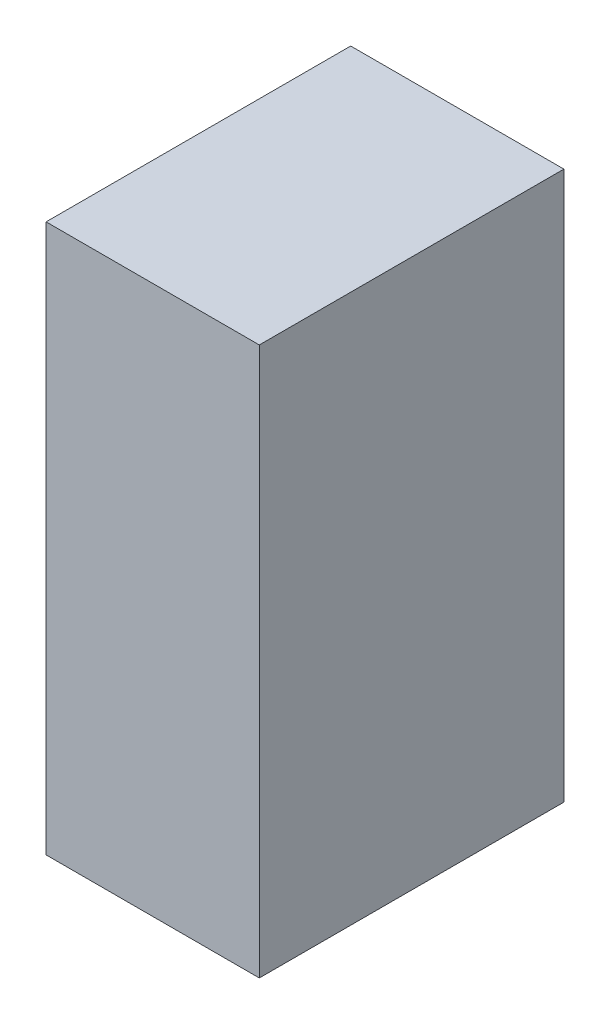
from build123d import *

# Parameters (mm, degrees)
SKETCH2_W           = 1400
SKETCH2_H           = 3600
BOSS_EXTRUDE2_DEPTH = 2000


with BuildPart() as part:
    # Sketch2 → Boss-Extrude2 (new body)
    with BuildSketch(Plane.XY):
        with Locations((0, 2500)):
            Rectangle(SKETCH2_W, SKETCH2_H)
    extrude(amount=BOSS_EXTRUDE2_DEPTH)


solid = part.part
